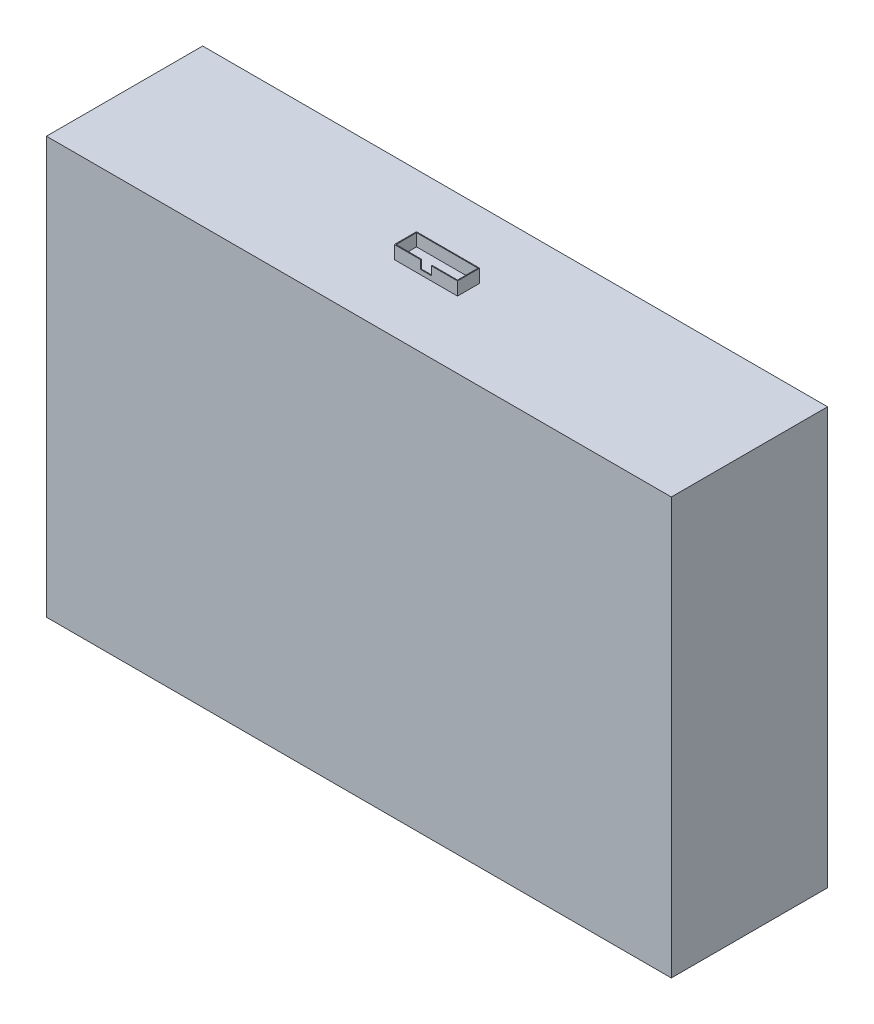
from build123d import *

# Parameters (mm, degrees)
SKETCH1_W          = 30
SKETCH1_H          = 10
EXTRUDE1_DEPTH     = 6
SHELL1_T           = 0.4
SKETCH2_W          = 5.25
SKETCH2_H          = 4.151431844
CUT_EXTRUDE1_DEPTH = 0.4
SKETCH3_W          = 304.8
SKETCH3_H          = 76.2
EXTRUDE2_DEPTH     = 203.2
SKETCH4_R          = 21
EXTRUDE3_DEPTH     = 10


with BuildPart() as part:
    # Sketch1 → Extrude1 (new body)
    with BuildSketch(Plane(origin=(0, 0, 0), x_dir=(1, 0, 0), z_dir=(0, 1, 0))):
        Rectangle(SKETCH1_W, SKETCH1_H)
    extrude(amount=EXTRUDE1_DEPTH)

    # Shell1
    shell1_openings = [part.faces().sort_by_distance(p)[0] for p in [
        (0, 6, 0),
    ]]
    offset(amount=SHELL1_T, openings=shell1_openings, kind=Kind.INTERSECTION)

    # Sketch2 → Cut-Extrude1 (cut)
    with BuildSketch(Plane(origin=(0, 0, 5), x_dir=(-1, 0, 0), z_dir=(0, 0, -1))):
        with Locations((0, 3.924284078)):
            Rectangle(SKETCH2_W, SKETCH2_H)
    extrude(amount=-CUT_EXTRUDE1_DEPTH, mode=Mode.SUBTRACT)

    # Sketch3 → Extrude2 (add)
    with BuildSketch(Plane.XZ.offset(0.4)):
        Rectangle(SKETCH3_W, SKETCH3_H)
    extrude(amount=EXTRUDE2_DEPTH)

    # Sketch4 → Extrude3 (add)
    with BuildSketch(Plane.XZ.offset(203.6)):
        with Locations(Location((-102.411177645, 0, 0), (0, 0, 270))):
            Circle(SKETCH4_R)
    extrude(amount=EXTRUDE3_DEPTH)


solid = part.part
